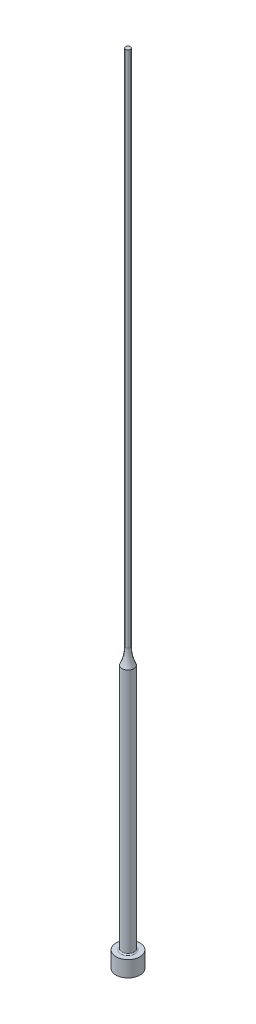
ISO-10303-21;
HEADER;
FILE_DESCRIPTION(('STEP AP214'),'2;1');
FILE_NAME('part.step','',(''),(''),'','','');
FILE_SCHEMA(('AUTOMOTIVE_DESIGN { 1 0 10303 214 1 1 1 1 }'));
ENDSEC;
DATA;
#1=APPLICATION_CONTEXT('core data for automotive mechanical design processes');
#2=APPLICATION_PROTOCOL_DEFINITION('international standard','automotive_design',2000,#1);
#3=PRODUCT_CONTEXT('',#1,'mechanical');
#4=PRODUCT('Part','Part','',(#3));
#5=PRODUCT_RELATED_PRODUCT_CATEGORY('part','',(#4));
#6=PRODUCT_DEFINITION_FORMATION('','',#4);
#7=PRODUCT_DEFINITION_CONTEXT('part definition',#1,'design');
#8=PRODUCT_DEFINITION('design','',#6,#7);
#9=PRODUCT_DEFINITION_SHAPE('','',#8);
#10=(LENGTH_UNIT() NAMED_UNIT(*) SI_UNIT(.MILLI.,.METRE.));
#11=(NAMED_UNIT(*) PLANE_ANGLE_UNIT() SI_UNIT($,.RADIAN.));
#12=(NAMED_UNIT(*) SI_UNIT($,.STERADIAN.) SOLID_ANGLE_UNIT());
#13=UNCERTAINTY_MEASURE_WITH_UNIT(LENGTH_MEASURE(1.E-05),#10,'distance_accuracy_value','');
#14=(GEOMETRIC_REPRESENTATION_CONTEXT(3) GLOBAL_UNCERTAINTY_ASSIGNED_CONTEXT((#13)) GLOBAL_UNIT_ASSIGNED_CONTEXT((#10,
#11,#12)) REPRESENTATION_CONTEXT('',''));
#15=CARTESIAN_POINT('',(0.,0.,0.));
#16=DIRECTION('',(0.,0.,1.));
#17=DIRECTION('',(1.,0.,0.));
#18=AXIS2_PLACEMENT_3D('',#15,#16,#17);
#19=CARTESIAN_POINT('',(0.600000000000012,200.,0.));
#20=DIRECTION('',(0.,-1.,0.));
#21=DIRECTION('',(1.,0.,0.));
#22=AXIS2_PLACEMENT_3D('',#19,#20,#21);
#23=PLANE('',#22);
#24=CARTESIAN_POINT('',(0.,200.,0.));
#25=DIRECTION('',(0.,1.,0.));
#26=DIRECTION('',(-1.,0.,0.));
#27=AXIS2_PLACEMENT_3D('',#24,#25,#26);
#28=CIRCLE('',#27,0.600000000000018);
#29=CARTESIAN_POINT('',(-0.600000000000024,200.,0.));
#30=VERTEX_POINT('',#29);
#31=EDGE_CURVE('E10',#30,#30,#28,.T.);
#32=ORIENTED_EDGE('',*,*,#31,.T.);
#33=EDGE_LOOP('',(#32));
#34=FACE_BOUND('',#33,.T.);
#35=ADVANCED_FACE('F30',(#34),#23,.F.);
#36=CARTESIAN_POINT('',(0.,200.,0.));
#37=DIRECTION('',(0.,1.,0.));
#38=DIRECTION('',(-1.,0.,0.));
#39=AXIS2_PLACEMENT_3D('',#36,#37,#38);
#40=CYLINDRICAL_SURFACE('',#39,0.600000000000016);
#41=ORIENTED_EDGE('',*,*,#31,.F.);
#42=EDGE_LOOP('',(#41));
#43=FACE_BOUND('',#42,.T.);
#44=CARTESIAN_POINT('',(0.,70.,0.));
#45=DIRECTION('',(0.,1.,0.));
#46=DIRECTION('',(-1.,0.,0.));
#47=AXIS2_PLACEMENT_3D('',#44,#45,#46);
#48=CIRCLE('',#47,0.600000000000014);
#49=CARTESIAN_POINT('',(-0.600000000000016,70.,0.));
#50=VERTEX_POINT('',#49);
#51=EDGE_CURVE('E36',#50,#50,#48,.T.);
#52=ORIENTED_EDGE('',*,*,#51,.T.);
#53=EDGE_LOOP('',(#52));
#54=FACE_BOUND('',#53,.T.);
#55=ADVANCED_FACE('F71',(#43,#54),#40,.T.);
#56=CARTESIAN_POINT('',(0.,70.,0.));
#57=DIRECTION('',(0.,1.,0.));
#58=DIRECTION('',(-1.,0.,0.));
#59=AXIS2_PLACEMENT_3D('',#56,#57,#58);
#60=TOROIDAL_SURFACE('',#59,10.6,10.);
#61=ORIENTED_EDGE('',*,*,#51,.F.);
#62=EDGE_LOOP('',(#61));
#63=FACE_BOUND('',#62,.T.);
#64=CARTESIAN_POINT('',(0.,65.8539175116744,0.));
#65=DIRECTION('',(0.,1.,0.));
#66=DIRECTION('',(-1.,0.,0.));
#67=AXIS2_PLACEMENT_3D('',#64,#65,#66);
#68=CIRCLE('',#67,1.50000000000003);
#69=CARTESIAN_POINT('',(-1.50000000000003,65.8539175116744,0.));
#70=VERTEX_POINT('',#69);
#71=EDGE_CURVE('E40',#70,#70,#68,.T.);
#72=ORIENTED_EDGE('',*,*,#71,.T.);
#73=EDGE_LOOP('',(#72));
#74=FACE_BOUND('',#73,.T.);
#75=ADVANCED_FACE('F75',(#63,#74),#60,.F.);
#76=CARTESIAN_POINT('',(0.,200.,0.));
#77=DIRECTION('',(0.,1.,0.));
#78=DIRECTION('',(-1.,0.,0.));
#79=AXIS2_PLACEMENT_3D('',#76,#77,#78);
#80=CYLINDRICAL_SURFACE('',#79,1.50000000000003);
#81=ORIENTED_EDGE('',*,*,#71,.F.);
#82=EDGE_LOOP('',(#81));
#83=FACE_BOUND('',#82,.T.);
#84=CARTESIAN_POINT('',(0.,4.3,0.));
#85=DIRECTION('',(0.,1.,0.));
#86=DIRECTION('',(-1.,0.,0.));
#87=AXIS2_PLACEMENT_3D('',#84,#85,#86);
#88=CIRCLE('',#87,1.50000000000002);
#89=CARTESIAN_POINT('',(-1.50000000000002,4.3,0.));
#90=VERTEX_POINT('',#89);
#91=EDGE_CURVE('E44',#90,#90,#88,.T.);
#92=ORIENTED_EDGE('',*,*,#91,.T.);
#93=EDGE_LOOP('',(#92));
#94=FACE_BOUND('',#93,.T.);
#95=ADVANCED_FACE('F80',(#83,#94),#80,.T.);
#96=CARTESIAN_POINT('',(0.,4.3,0.));
#97=DIRECTION('',(0.,1.,0.));
#98=DIRECTION('',(-1.,0.,0.));
#99=AXIS2_PLACEMENT_3D('',#96,#97,#98);
#100=TOROIDAL_SURFACE('',#99,1.80000000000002,0.3);
#101=ORIENTED_EDGE('',*,*,#91,.F.);
#102=EDGE_LOOP('',(#101));
#103=FACE_BOUND('',#102,.T.);
#104=CARTESIAN_POINT('',(0.,4.,0.));
#105=DIRECTION('',(0.,1.,0.));
#106=DIRECTION('',(-1.,0.,0.));
#107=AXIS2_PLACEMENT_3D('',#104,#105,#106);
#108=CIRCLE('',#107,1.80000000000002);
#109=CARTESIAN_POINT('',(-1.80000000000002,4.,0.));
#110=VERTEX_POINT('',#109);
#111=EDGE_CURVE('E49',#110,#110,#108,.T.);
#112=ORIENTED_EDGE('',*,*,#111,.T.);
#113=EDGE_LOOP('',(#112));
#114=FACE_BOUND('',#113,.T.);
#115=ADVANCED_FACE('F86',(#103,#114),#100,.F.);
#116=CARTESIAN_POINT('',(3.00000000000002,4.,0.));
#117=DIRECTION('',(0.,-1.,0.));
#118=DIRECTION('',(1.,0.,0.));
#119=AXIS2_PLACEMENT_3D('',#116,#117,#118);
#120=PLANE('',#119);
#121=ORIENTED_EDGE('',*,*,#111,.F.);
#122=EDGE_LOOP('',(#121));
#123=FACE_BOUND('',#122,.T.);
#124=CARTESIAN_POINT('',(0.,4.,0.));
#125=DIRECTION('',(0.,1.,0.));
#126=DIRECTION('',(-1.,0.,0.));
#127=AXIS2_PLACEMENT_3D('',#124,#125,#126);
#128=CIRCLE('',#127,3.00000000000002);
#129=CARTESIAN_POINT('',(-3.00000000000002,4.,0.));
#130=VERTEX_POINT('',#129);
#131=EDGE_CURVE('E52',#130,#130,#128,.T.);
#132=ORIENTED_EDGE('',*,*,#131,.T.);
#133=EDGE_LOOP('',(#132));
#134=FACE_BOUND('',#133,.T.);
#135=ADVANCED_FACE('F67',(#123,#134),#120,.F.);
#136=CARTESIAN_POINT('',(0.,200.,0.));
#137=DIRECTION('',(0.,1.,0.));
#138=DIRECTION('',(-1.,0.,0.));
#139=AXIS2_PLACEMENT_3D('',#136,#137,#138);
#140=CYLINDRICAL_SURFACE('',#139,3.00000000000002);
#141=ORIENTED_EDGE('',*,*,#131,.F.);
#142=EDGE_LOOP('',(#141));
#143=FACE_BOUND('',#142,.T.);
#144=CARTESIAN_POINT('',(0.,0.,0.));
#145=DIRECTION('',(0.,1.,0.));
#146=DIRECTION('',(-1.,0.,0.));
#147=AXIS2_PLACEMENT_3D('',#144,#145,#146);
#148=CIRCLE('',#147,3.00000000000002);
#149=CARTESIAN_POINT('',(-3.00000000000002,0.,0.));
#150=VERTEX_POINT('',#149);
#151=EDGE_CURVE('E55',#150,#150,#148,.T.);
#152=ORIENTED_EDGE('',*,*,#151,.T.);
#153=EDGE_LOOP('',(#152));
#154=FACE_BOUND('',#153,.T.);
#155=ADVANCED_FACE('F59',(#143,#154),#140,.T.);
#156=CARTESIAN_POINT('',(0.,0.,0.));
#157=DIRECTION('',(0.,1.,0.));
#158=DIRECTION('',(-1.,0.,0.));
#159=AXIS2_PLACEMENT_3D('',#156,#157,#158);
#160=PLANE('',#159);
#161=ORIENTED_EDGE('',*,*,#151,.F.);
#162=EDGE_LOOP('',(#161));
#163=FACE_BOUND('',#162,.T.);
#164=ADVANCED_FACE('F61',(#163),#160,.F.);
#165=CLOSED_SHELL('',(#35,#55,#75,#95,#115,#135,#155,#164));
#166=MANIFOLD_SOLID_BREP('B2',#165);
#167=ADVANCED_BREP_SHAPE_REPRESENTATION('',(#18,#166),#14);
#168=SHAPE_DEFINITION_REPRESENTATION(#9,#167);
ENDSEC;
END-ISO-10303-21;
